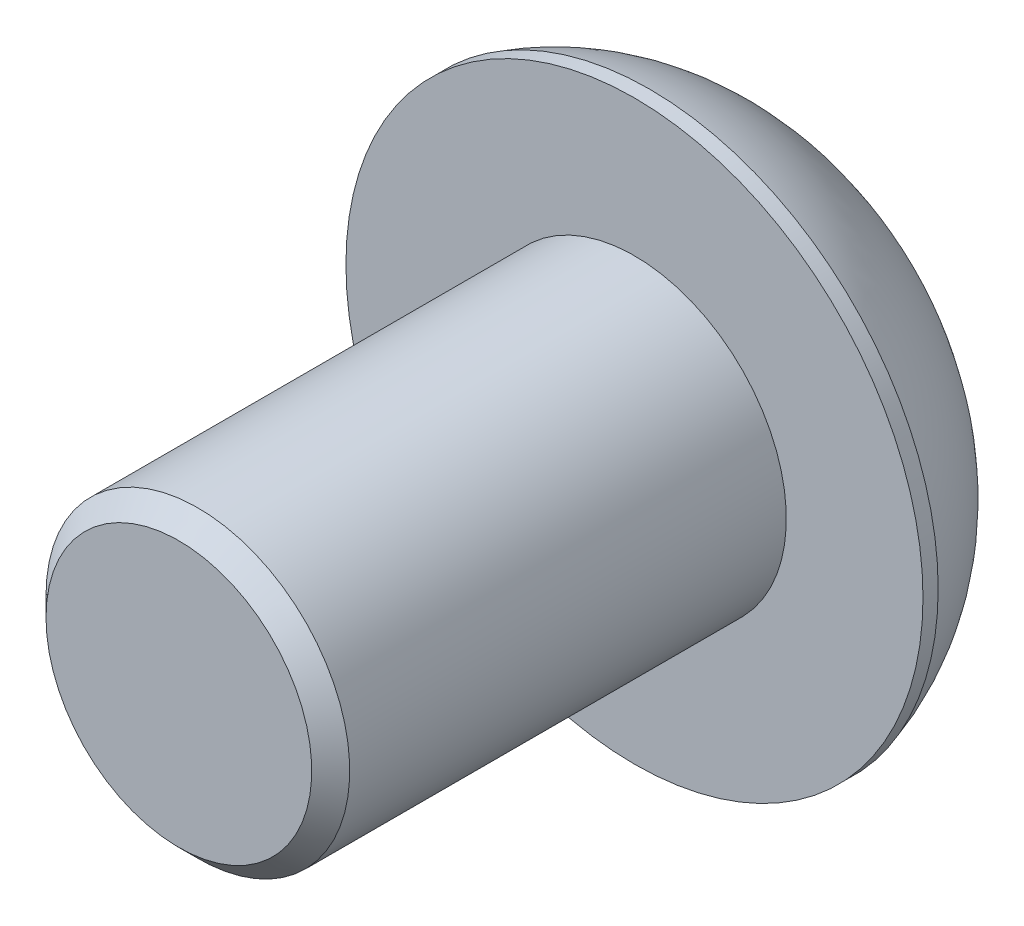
from build123d import *

# Parameters (mm, degrees)
EXTRUDE1_DEPTH = 1.25


with BuildPart() as part:
    # Sketch1 → Revolve1 (revolve)
    with BuildSketch(Plane(origin=(0, 0, 0), x_dir=(1, 0, 0), z_dir=(0, 1, 0)), mode=Mode.PRIVATE) as revolve1_sk:
        with BuildLine():
            Line((1.9, 2.2), (0, 2.2))
            Line((0, 2.2), (0, -6))
            Line((0, -6), (1.75, -6))
            Line((1.75, -6), (2, -5.75))
            Line((2, -5.75), (2, 0))
            Line((2, 0), (3.8, 0))
            Line((3.8, 0), (3.8, 0.2))
            ThreePointArc((3.8, 0.2), (3.093517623, 1.431341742), (1.9, 2.2))
        make_face()
    revolve(revolve1_sk.sketch.rotate(Axis((0, 0, 0), (0, 0, 1)), 180), axis=Axis((0, 0, 0), (0, 0, 1)))

    # Sketch2 → Extrude1 (cut)
    with BuildSketch(Plane(origin=(0, 0, -2.2), x_dir=(-1, 0, 0), z_dir=(0, 0, -1))):
        Polygon((1.443375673, 0), (0.721687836, 1.25), (-0.721687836, 1.25), (-1.443375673, 0), (-0.721687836, -1.25), (0.721687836, -1.25), align=None)
    extrude(amount=-EXTRUDE1_DEPTH, mode=Mode.SUBTRACT)


solid = part.part
